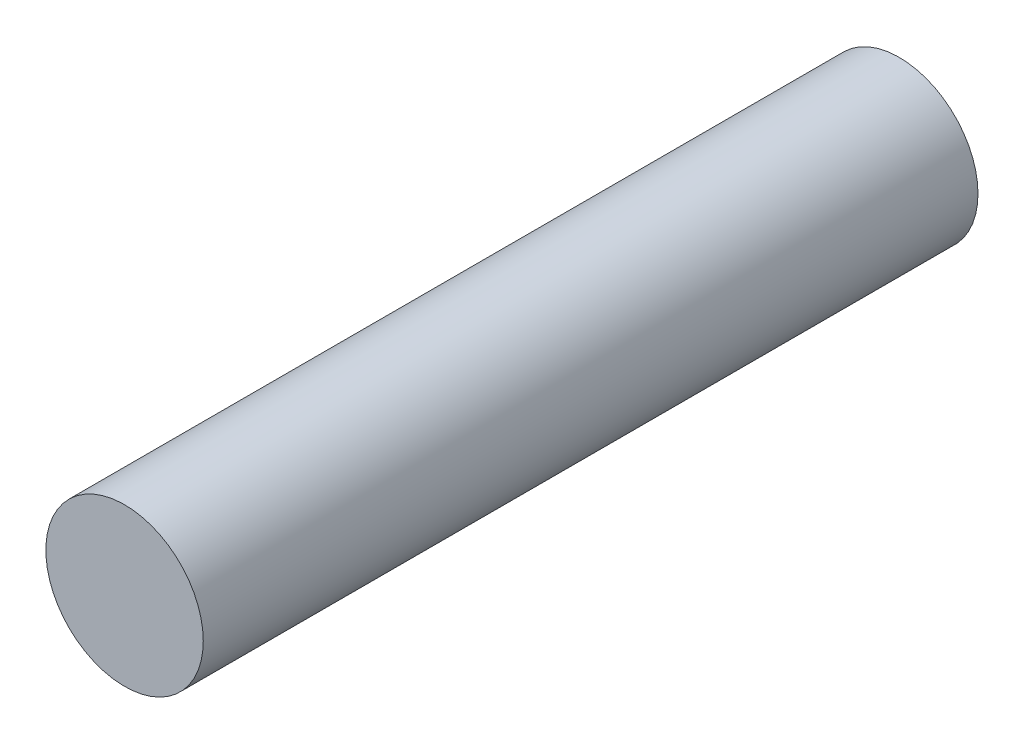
ISO-10303-21;
HEADER;
FILE_DESCRIPTION(('STEP AP214'),'2;1');
FILE_NAME('part.step','',(''),(''),'','','');
FILE_SCHEMA(('AUTOMOTIVE_DESIGN { 1 0 10303 214 1 1 1 1 }'));
ENDSEC;
DATA;
#1=APPLICATION_CONTEXT('core data for automotive mechanical design processes');
#2=APPLICATION_PROTOCOL_DEFINITION('international standard','automotive_design',2000,#1);
#3=PRODUCT_CONTEXT('',#1,'mechanical');
#4=PRODUCT('Part','Part','',(#3));
#5=PRODUCT_RELATED_PRODUCT_CATEGORY('part','',(#4));
#6=PRODUCT_DEFINITION_FORMATION('','',#4);
#7=PRODUCT_DEFINITION_CONTEXT('part definition',#1,'design');
#8=PRODUCT_DEFINITION('design','',#6,#7);
#9=PRODUCT_DEFINITION_SHAPE('','',#8);
#10=(LENGTH_UNIT() NAMED_UNIT(*) SI_UNIT(.MILLI.,.METRE.));
#11=(NAMED_UNIT(*) PLANE_ANGLE_UNIT() SI_UNIT($,.RADIAN.));
#12=(NAMED_UNIT(*) SI_UNIT($,.STERADIAN.) SOLID_ANGLE_UNIT());
#13=UNCERTAINTY_MEASURE_WITH_UNIT(LENGTH_MEASURE(1.E-05),#10,'distance_accuracy_value','');
#14=(GEOMETRIC_REPRESENTATION_CONTEXT(3) GLOBAL_UNCERTAINTY_ASSIGNED_CONTEXT((#13)) GLOBAL_UNIT_ASSIGNED_CONTEXT((#10,
#11,#12)) REPRESENTATION_CONTEXT('',''));
#15=CARTESIAN_POINT('',(0.,0.,0.));
#16=DIRECTION('',(0.,0.,1.));
#17=DIRECTION('',(1.,0.,0.));
#18=AXIS2_PLACEMENT_3D('',#15,#16,#17);
#19=CARTESIAN_POINT('',(0.,0.,14.764823));
#20=DIRECTION('',(0.,0.,1.));
#21=DIRECTION('',(1.,0.,0.));
#22=AXIS2_PLACEMENT_3D('',#19,#20,#21);
#23=PLANE('',#22);
#24=CARTESIAN_POINT('',(0.,0.,14.764823));
#25=DIRECTION('',(0.,0.,1.));
#26=DIRECTION('',(1.,0.,0.));
#27=AXIS2_PLACEMENT_3D('',#24,#25,#26);
#28=CIRCLE('',#27,1.5);
#29=CARTESIAN_POINT('',(1.5,0.,14.764823));
#30=VERTEX_POINT('',#29);
#31=EDGE_CURVE('E10',#30,#30,#28,.T.);
#32=ORIENTED_EDGE('',*,*,#31,.T.);
#33=EDGE_LOOP('',(#32));
#34=FACE_BOUND('',#33,.T.);
#35=ADVANCED_FACE('F16',(#34),#23,.T.);
#36=CARTESIAN_POINT('',(0.,0.,0.));
#37=DIRECTION('',(0.,0.,1.));
#38=DIRECTION('',(1.,0.,0.));
#39=AXIS2_PLACEMENT_3D('',#36,#37,#38);
#40=PLANE('',#39);
#41=CARTESIAN_POINT('',(0.,0.,0.));
#42=DIRECTION('',(0.,0.,1.));
#43=DIRECTION('',(1.,0.,0.));
#44=AXIS2_PLACEMENT_3D('',#41,#42,#43);
#45=CIRCLE('',#44,1.5);
#46=CARTESIAN_POINT('',(1.5,0.,0.));
#47=VERTEX_POINT('',#46);
#48=EDGE_CURVE('E41',#47,#47,#45,.T.);
#49=ORIENTED_EDGE('',*,*,#48,.F.);
#50=EDGE_LOOP('',(#49));
#51=FACE_BOUND('',#50,.T.);
#52=ADVANCED_FACE('F55',(#51),#40,.F.);
#53=CARTESIAN_POINT('',(0.,0.,0.));
#54=DIRECTION('',(0.,0.,-1.));
#55=DIRECTION('',(1.,0.,0.));
#56=AXIS2_PLACEMENT_3D('',#53,#54,#55);
#57=CYLINDRICAL_SURFACE('',#56,1.5);
#58=ORIENTED_EDGE('',*,*,#48,.T.);
#59=DIRECTION('',(0.,0.,1.));
#60=VECTOR('',#59,1.);
#61=CARTESIAN_POINT('',(1.5,0.,0.));
#62=LINE('',#61,#60);
#63=EDGE_CURVE('E24',#47,#30,#62,.T.);
#64=ORIENTED_EDGE('',*,*,#63,.T.);
#65=ORIENTED_EDGE('',*,*,#31,.F.);
#66=ORIENTED_EDGE('',*,*,#63,.F.);
#67=EDGE_LOOP('',(#58,#64,#65,#66));
#68=FACE_BOUND('',#67,.T.);
#69=ADVANCED_FACE('F39',(#68),#57,.T.);
#70=CLOSED_SHELL('',(#35,#52,#69));
#71=MANIFOLD_SOLID_BREP('B1',#70);
#72=ADVANCED_BREP_SHAPE_REPRESENTATION('',(#18,#71),#14);
#73=SHAPE_DEFINITION_REPRESENTATION(#9,#72);
ENDSEC;
END-ISO-10303-21;
